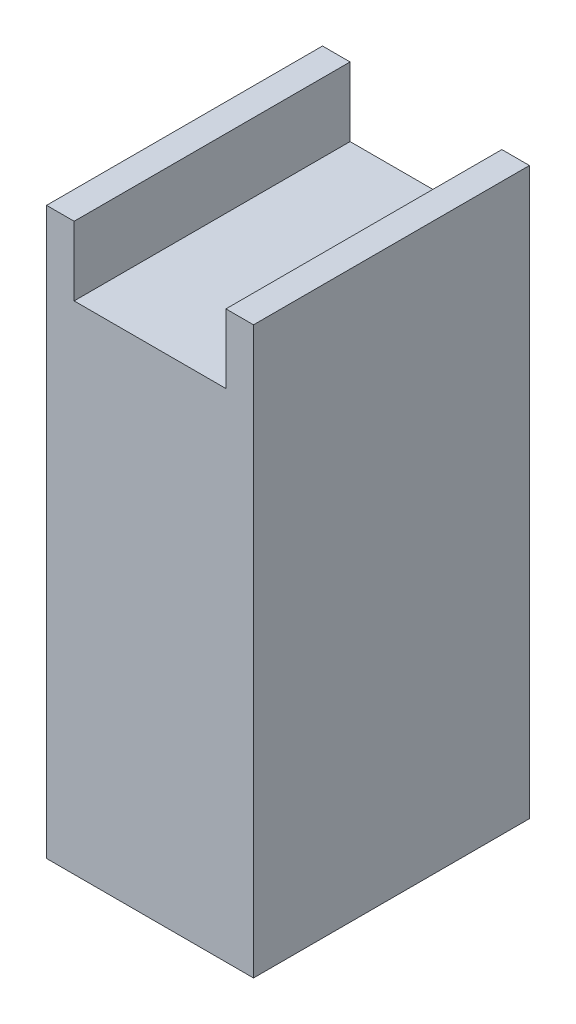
ISO-10303-21;
HEADER;
FILE_DESCRIPTION(('STEP AP214'),'2;1');
FILE_NAME('part.step','',(''),(''),'','','');
FILE_SCHEMA(('AUTOMOTIVE_DESIGN { 1 0 10303 214 1 1 1 1 }'));
ENDSEC;
DATA;
#1=APPLICATION_CONTEXT('core data for automotive mechanical design processes');
#2=APPLICATION_PROTOCOL_DEFINITION('international standard','automotive_design',2000,#1);
#3=PRODUCT_CONTEXT('',#1,'mechanical');
#4=PRODUCT('Part','Part','',(#3));
#5=PRODUCT_RELATED_PRODUCT_CATEGORY('part','',(#4));
#6=PRODUCT_DEFINITION_FORMATION('','',#4);
#7=PRODUCT_DEFINITION_CONTEXT('part definition',#1,'design');
#8=PRODUCT_DEFINITION('design','',#6,#7);
#9=PRODUCT_DEFINITION_SHAPE('','',#8);
#10=(LENGTH_UNIT() NAMED_UNIT(*) SI_UNIT(.MILLI.,.METRE.));
#11=(NAMED_UNIT(*) PLANE_ANGLE_UNIT() SI_UNIT($,.RADIAN.));
#12=(NAMED_UNIT(*) SI_UNIT($,.STERADIAN.) SOLID_ANGLE_UNIT());
#13=UNCERTAINTY_MEASURE_WITH_UNIT(LENGTH_MEASURE(1.E-05),#10,'distance_accuracy_value','');
#14=(GEOMETRIC_REPRESENTATION_CONTEXT(3) GLOBAL_UNCERTAINTY_ASSIGNED_CONTEXT((#13)) GLOBAL_UNIT_ASSIGNED_CONTEXT((#10,
#11,#12)) REPRESENTATION_CONTEXT('',''));
#15=CARTESIAN_POINT('',(0.,0.,0.));
#16=DIRECTION('',(0.,0.,1.));
#17=DIRECTION('',(1.,0.,0.));
#18=AXIS2_PLACEMENT_3D('',#15,#16,#17);
#19=CARTESIAN_POINT('',(-9.525,0.,25.4));
#20=DIRECTION('',(0.,1.,0.));
#21=DIRECTION('',(0.,0.,1.));
#22=AXIS2_PLACEMENT_3D('',#19,#20,#21);
#23=PLANE('',#22);
#24=DIRECTION('',(1.,0.,0.));
#25=VECTOR('',#24,1.);
#26=CARTESIAN_POINT('',(-9.525,0.,0.));
#27=LINE('',#26,#25);
#28=CARTESIAN_POINT('',(-9.525,0.,0.));
#29=VERTEX_POINT('',#28);
#30=CARTESIAN_POINT('',(9.525,0.,0.));
#31=VERTEX_POINT('',#30);
#32=EDGE_CURVE('E130',#29,#31,#27,.T.);
#33=ORIENTED_EDGE('',*,*,#32,.T.);
#34=DIRECTION('',(0.,0.,-1.));
#35=VECTOR('',#34,1.);
#36=CARTESIAN_POINT('',(9.525,0.,25.4));
#37=LINE('',#36,#35);
#38=CARTESIAN_POINT('',(9.525,0.,25.4));
#39=VERTEX_POINT('',#38);
#40=EDGE_CURVE('E11',#39,#31,#37,.T.);
#41=ORIENTED_EDGE('',*,*,#40,.F.);
#42=DIRECTION('',(1.,0.,0.));
#43=VECTOR('',#42,1.);
#44=CARTESIAN_POINT('',(-9.525,0.,25.4));
#45=LINE('',#44,#43);
#46=CARTESIAN_POINT('',(-9.525,0.,25.4));
#47=VERTEX_POINT('',#46);
#48=EDGE_CURVE('E144',#47,#39,#45,.T.);
#49=ORIENTED_EDGE('',*,*,#48,.F.);
#50=DIRECTION('',(0.,0.,-1.));
#51=VECTOR('',#50,1.);
#52=CARTESIAN_POINT('',(-9.525,0.,25.4));
#53=LINE('',#52,#51);
#54=EDGE_CURVE('E126',#47,#29,#53,.T.);
#55=ORIENTED_EDGE('',*,*,#54,.T.);
#56=EDGE_LOOP('',(#33,#41,#49,#55));
#57=FACE_BOUND('',#56,.T.);
#58=ADVANCED_FACE('F34',(#57),#23,.F.);
#59=CARTESIAN_POINT('',(9.525,0.,25.4));
#60=DIRECTION('',(-1.,0.,0.));
#61=DIRECTION('',(0.,0.,1.));
#62=AXIS2_PLACEMENT_3D('',#59,#60,#61);
#63=PLANE('',#62);
#64=DIRECTION('',(0.,1.,0.));
#65=VECTOR('',#64,1.);
#66=CARTESIAN_POINT('',(9.525,0.,0.));
#67=LINE('',#66,#65);
#68=CARTESIAN_POINT('',(9.525,52.07,0.));
#69=VERTEX_POINT('',#68);
#70=EDGE_CURVE('E133',#31,#69,#67,.T.);
#71=ORIENTED_EDGE('',*,*,#70,.T.);
#72=DIRECTION('',(0.,0.,-1.));
#73=VECTOR('',#72,1.);
#74=CARTESIAN_POINT('',(9.525,52.07,25.4));
#75=LINE('',#74,#73);
#76=CARTESIAN_POINT('',(9.525,52.07,25.4));
#77=VERTEX_POINT('',#76);
#78=EDGE_CURVE('E42',#77,#69,#75,.T.);
#79=ORIENTED_EDGE('',*,*,#78,.F.);
#80=DIRECTION('',(0.,1.,0.));
#81=VECTOR('',#80,1.);
#82=CARTESIAN_POINT('',(9.525,0.,25.4));
#83=LINE('',#82,#81);
#84=EDGE_CURVE('E93',#39,#77,#83,.T.);
#85=ORIENTED_EDGE('',*,*,#84,.F.);
#86=ORIENTED_EDGE('',*,*,#40,.T.);
#87=EDGE_LOOP('',(#71,#79,#85,#86));
#88=FACE_BOUND('',#87,.T.);
#89=ADVANCED_FACE('F179',(#88),#63,.F.);
#90=CARTESIAN_POINT('',(9.525,52.07,25.4));
#91=DIRECTION('',(0.,-1.,0.));
#92=DIRECTION('',(0.,0.,-1.));
#93=AXIS2_PLACEMENT_3D('',#90,#91,#92);
#94=PLANE('',#93);
#95=DIRECTION('',(-1.,0.,0.));
#96=VECTOR('',#95,1.);
#97=CARTESIAN_POINT('',(9.525,52.07,0.));
#98=LINE('',#97,#96);
#99=CARTESIAN_POINT('',(6.985,52.07,0.));
#100=VERTEX_POINT('',#99);
#101=EDGE_CURVE('E135',#69,#100,#98,.T.);
#102=ORIENTED_EDGE('',*,*,#101,.T.);
#103=DIRECTION('',(0.,0.,-1.));
#104=VECTOR('',#103,1.);
#105=CARTESIAN_POINT('',(6.985,52.07,25.4));
#106=LINE('',#105,#104);
#107=CARTESIAN_POINT('',(6.985,52.07,25.4));
#108=VERTEX_POINT('',#107);
#109=EDGE_CURVE('E151',#108,#100,#106,.T.);
#110=ORIENTED_EDGE('',*,*,#109,.F.);
#111=DIRECTION('',(-1.,0.,0.));
#112=VECTOR('',#111,1.);
#113=CARTESIAN_POINT('',(9.525,52.07,25.4));
#114=LINE('',#113,#112);
#115=EDGE_CURVE('E159',#77,#108,#114,.T.);
#116=ORIENTED_EDGE('',*,*,#115,.F.);
#117=ORIENTED_EDGE('',*,*,#78,.T.);
#118=EDGE_LOOP('',(#102,#110,#116,#117));
#119=FACE_BOUND('',#118,.T.);
#120=ADVANCED_FACE('F157',(#119),#94,.F.);
#121=CARTESIAN_POINT('',(6.985,52.07,25.4));
#122=DIRECTION('',(1.,0.,0.));
#123=DIRECTION('',(0.,1.,0.));
#124=AXIS2_PLACEMENT_3D('',#121,#122,#123);
#125=PLANE('',#124);
#126=DIRECTION('',(0.,-1.,0.));
#127=VECTOR('',#126,1.);
#128=CARTESIAN_POINT('',(6.985,52.07,0.));
#129=LINE('',#128,#127);
#130=CARTESIAN_POINT('',(6.985,45.72,0.));
#131=VERTEX_POINT('',#130);
#132=EDGE_CURVE('E137',#100,#131,#129,.T.);
#133=ORIENTED_EDGE('',*,*,#132,.T.);
#134=DIRECTION('',(0.,0.,-1.));
#135=VECTOR('',#134,1.);
#136=CARTESIAN_POINT('',(6.985,45.72,25.4));
#137=LINE('',#136,#135);
#138=CARTESIAN_POINT('',(6.985,45.72,25.4));
#139=VERTEX_POINT('',#138);
#140=EDGE_CURVE('E148',#139,#131,#137,.T.);
#141=ORIENTED_EDGE('',*,*,#140,.F.);
#142=DIRECTION('',(0.,-1.,0.));
#143=VECTOR('',#142,1.);
#144=CARTESIAN_POINT('',(6.985,52.07,25.4));
#145=LINE('',#144,#143);
#146=EDGE_CURVE('E171',#108,#139,#145,.T.);
#147=ORIENTED_EDGE('',*,*,#146,.F.);
#148=ORIENTED_EDGE('',*,*,#109,.T.);
#149=EDGE_LOOP('',(#133,#141,#147,#148));
#150=FACE_BOUND('',#149,.T.);
#151=ADVANCED_FACE('F167',(#150),#125,.F.);
#152=CARTESIAN_POINT('',(-6.985,45.72,25.4));
#153=DIRECTION('',(0.,-1.,0.));
#154=DIRECTION('',(0.,0.,-1.));
#155=AXIS2_PLACEMENT_3D('',#152,#153,#154);
#156=PLANE('',#155);
#157=DIRECTION('',(-1.,0.,0.));
#158=VECTOR('',#157,1.);
#159=CARTESIAN_POINT('',(-6.985,45.72,0.));
#160=LINE('',#159,#158);
#161=CARTESIAN_POINT('',(-6.985,45.72,0.));
#162=VERTEX_POINT('',#161);
#163=EDGE_CURVE('E139',#131,#162,#160,.T.);
#164=ORIENTED_EDGE('',*,*,#163,.T.);
#165=DIRECTION('',(0.,0.,-1.));
#166=VECTOR('',#165,1.);
#167=CARTESIAN_POINT('',(-6.985,45.72,25.4));
#168=LINE('',#167,#166);
#169=CARTESIAN_POINT('',(-6.985,45.72,25.4));
#170=VERTEX_POINT('',#169);
#171=EDGE_CURVE('E121',#170,#162,#168,.T.);
#172=ORIENTED_EDGE('',*,*,#171,.F.);
#173=DIRECTION('',(-1.,0.,0.));
#174=VECTOR('',#173,1.);
#175=CARTESIAN_POINT('',(-6.985,45.72,25.4));
#176=LINE('',#175,#174);
#177=EDGE_CURVE('E112',#139,#170,#176,.T.);
#178=ORIENTED_EDGE('',*,*,#177,.F.);
#179=ORIENTED_EDGE('',*,*,#140,.T.);
#180=EDGE_LOOP('',(#164,#172,#178,#179));
#181=FACE_BOUND('',#180,.T.);
#182=ADVANCED_FACE('F170',(#181),#156,.F.);
#183=CARTESIAN_POINT('',(-6.985,52.07,25.4));
#184=DIRECTION('',(-1.,0.,0.));
#185=DIRECTION('',(0.,-1.,0.));
#186=AXIS2_PLACEMENT_3D('',#183,#184,#185);
#187=PLANE('',#186);
#188=DIRECTION('',(0.,1.,0.));
#189=VECTOR('',#188,1.);
#190=CARTESIAN_POINT('',(-6.985,52.07,0.));
#191=LINE('',#190,#189);
#192=CARTESIAN_POINT('',(-6.985,52.07,0.));
#193=VERTEX_POINT('',#192);
#194=EDGE_CURVE('E120',#162,#193,#191,.T.);
#195=ORIENTED_EDGE('',*,*,#194,.T.);
#196=DIRECTION('',(0.,0.,-1.));
#197=VECTOR('',#196,1.);
#198=CARTESIAN_POINT('',(-6.985,52.07,25.4));
#199=LINE('',#198,#197);
#200=CARTESIAN_POINT('',(-6.985,52.07,25.4));
#201=VERTEX_POINT('',#200);
#202=EDGE_CURVE('E117',#201,#193,#199,.T.);
#203=ORIENTED_EDGE('',*,*,#202,.F.);
#204=DIRECTION('',(0.,1.,0.));
#205=VECTOR('',#204,1.);
#206=CARTESIAN_POINT('',(-6.985,52.07,25.4));
#207=LINE('',#206,#205);
#208=EDGE_CURVE('E106',#170,#201,#207,.T.);
#209=ORIENTED_EDGE('',*,*,#208,.F.);
#210=ORIENTED_EDGE('',*,*,#171,.T.);
#211=EDGE_LOOP('',(#195,#203,#209,#210));
#212=FACE_BOUND('',#211,.T.);
#213=ADVANCED_FACE('F118',(#212),#187,.F.);
#214=CARTESIAN_POINT('',(-9.525,52.07,25.4));
#215=DIRECTION('',(0.,-1.,0.));
#216=DIRECTION('',(0.,0.,-1.));
#217=AXIS2_PLACEMENT_3D('',#214,#215,#216);
#218=PLANE('',#217);
#219=DIRECTION('',(-1.,0.,0.));
#220=VECTOR('',#219,1.);
#221=CARTESIAN_POINT('',(-9.525,52.07,0.));
#222=LINE('',#221,#220);
#223=CARTESIAN_POINT('',(-9.525,52.07,0.));
#224=VERTEX_POINT('',#223);
#225=EDGE_CURVE('E79',#193,#224,#222,.T.);
#226=ORIENTED_EDGE('',*,*,#225,.T.);
#227=DIRECTION('',(0.,0.,-1.));
#228=VECTOR('',#227,1.);
#229=CARTESIAN_POINT('',(-9.525,52.07,25.4));
#230=LINE('',#229,#228);
#231=CARTESIAN_POINT('',(-9.525,52.07,25.4));
#232=VERTEX_POINT('',#231);
#233=EDGE_CURVE('E122',#232,#224,#230,.T.);
#234=ORIENTED_EDGE('',*,*,#233,.F.);
#235=DIRECTION('',(-1.,0.,0.));
#236=VECTOR('',#235,1.);
#237=CARTESIAN_POINT('',(-9.525,52.07,25.4));
#238=LINE('',#237,#236);
#239=EDGE_CURVE('E110',#201,#232,#238,.T.);
#240=ORIENTED_EDGE('',*,*,#239,.F.);
#241=ORIENTED_EDGE('',*,*,#202,.T.);
#242=EDGE_LOOP('',(#226,#234,#240,#241));
#243=FACE_BOUND('',#242,.T.);
#244=ADVANCED_FACE('F124',(#243),#218,.F.);
#245=CARTESIAN_POINT('',(-9.525,0.,25.4));
#246=DIRECTION('',(1.,0.,0.));
#247=DIRECTION('',(0.,0.,-1.));
#248=AXIS2_PLACEMENT_3D('',#245,#246,#247);
#249=PLANE('',#248);
#250=DIRECTION('',(0.,-1.,0.));
#251=VECTOR('',#250,1.);
#252=CARTESIAN_POINT('',(-9.525,0.,0.));
#253=LINE('',#252,#251);
#254=EDGE_CURVE('E85',#224,#29,#253,.T.);
#255=ORIENTED_EDGE('',*,*,#254,.T.);
#256=ORIENTED_EDGE('',*,*,#54,.F.);
#257=DIRECTION('',(0.,-1.,0.));
#258=VECTOR('',#257,1.);
#259=CARTESIAN_POINT('',(-9.525,0.,25.4));
#260=LINE('',#259,#258);
#261=EDGE_CURVE('E50',#232,#47,#260,.T.);
#262=ORIENTED_EDGE('',*,*,#261,.F.);
#263=ORIENTED_EDGE('',*,*,#233,.T.);
#264=EDGE_LOOP('',(#255,#256,#262,#263));
#265=FACE_BOUND('',#264,.T.);
#266=ADVANCED_FACE('F195',(#265),#249,.F.);
#267=CARTESIAN_POINT('',(0.,0.,25.4));
#268=DIRECTION('',(0.,0.,1.));
#269=DIRECTION('',(1.,0.,0.));
#270=AXIS2_PLACEMENT_3D('',#267,#268,#269);
#271=PLANE('',#270);
#272=ORIENTED_EDGE('',*,*,#48,.T.);
#273=ORIENTED_EDGE('',*,*,#84,.T.);
#274=ORIENTED_EDGE('',*,*,#115,.T.);
#275=ORIENTED_EDGE('',*,*,#146,.T.);
#276=ORIENTED_EDGE('',*,*,#177,.T.);
#277=ORIENTED_EDGE('',*,*,#208,.T.);
#278=ORIENTED_EDGE('',*,*,#239,.T.);
#279=ORIENTED_EDGE('',*,*,#261,.T.);
#280=EDGE_LOOP('',(#272,#273,#274,#275,#276,#277,#278,#279));
#281=FACE_BOUND('',#280,.T.);
#282=ADVANCED_FACE('F108',(#281),#271,.T.);
#283=CARTESIAN_POINT('',(0.,0.,0.));
#284=DIRECTION('',(0.,0.,1.));
#285=DIRECTION('',(1.,0.,0.));
#286=AXIS2_PLACEMENT_3D('',#283,#284,#285);
#287=PLANE('',#286);
#288=ORIENTED_EDGE('',*,*,#32,.F.);
#289=ORIENTED_EDGE('',*,*,#254,.F.);
#290=ORIENTED_EDGE('',*,*,#225,.F.);
#291=ORIENTED_EDGE('',*,*,#194,.F.);
#292=ORIENTED_EDGE('',*,*,#163,.F.);
#293=ORIENTED_EDGE('',*,*,#132,.F.);
#294=ORIENTED_EDGE('',*,*,#101,.F.);
#295=ORIENTED_EDGE('',*,*,#70,.F.);
#296=EDGE_LOOP('',(#288,#289,#290,#291,#292,#293,#294,#295));
#297=FACE_BOUND('',#296,.T.);
#298=ADVANCED_FACE('F163',(#297),#287,.F.);
#299=CLOSED_SHELL('',(#58,#89,#120,#151,#182,#213,#244,#266,#282,#298));
#300=MANIFOLD_SOLID_BREP('B2',#299);
#301=ADVANCED_BREP_SHAPE_REPRESENTATION('',(#18,#300),#14);
#302=SHAPE_DEFINITION_REPRESENTATION(#9,#301);
ENDSEC;
END-ISO-10303-21;
